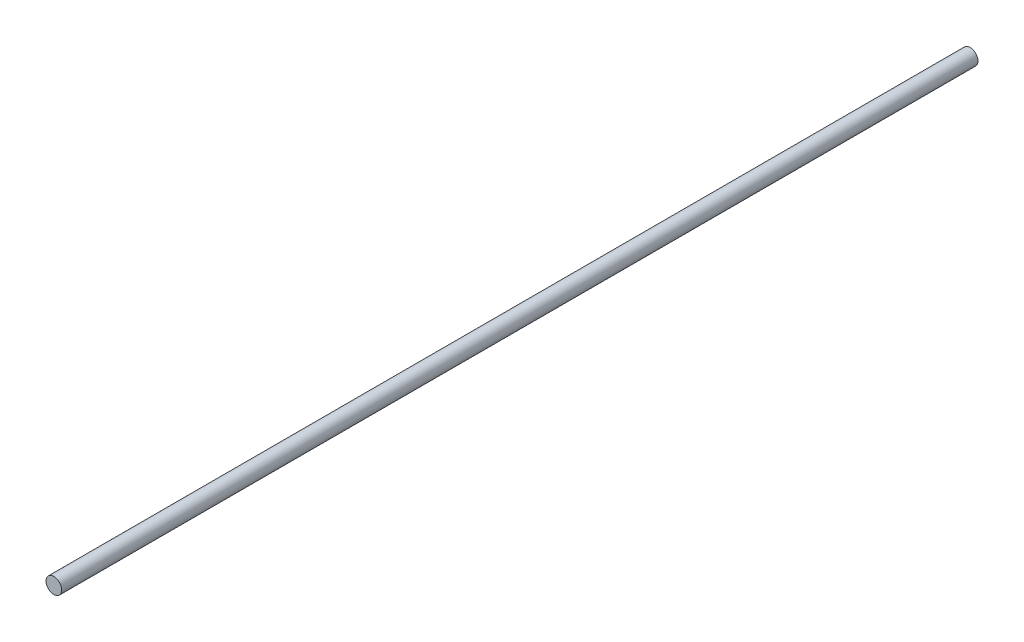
from build123d import *

# Parameters (mm, degrees)
SKETCH1_R           = 30
BOSS_EXTRUDE1_DEPTH = 3500


with BuildPart() as part:
    # Sketch1 → Boss-Extrude1 (new body)
    with BuildSketch(Plane.XY):
        Circle(SKETCH1_R)
    extrude(amount=-BOSS_EXTRUDE1_DEPTH)


solid = part.part
